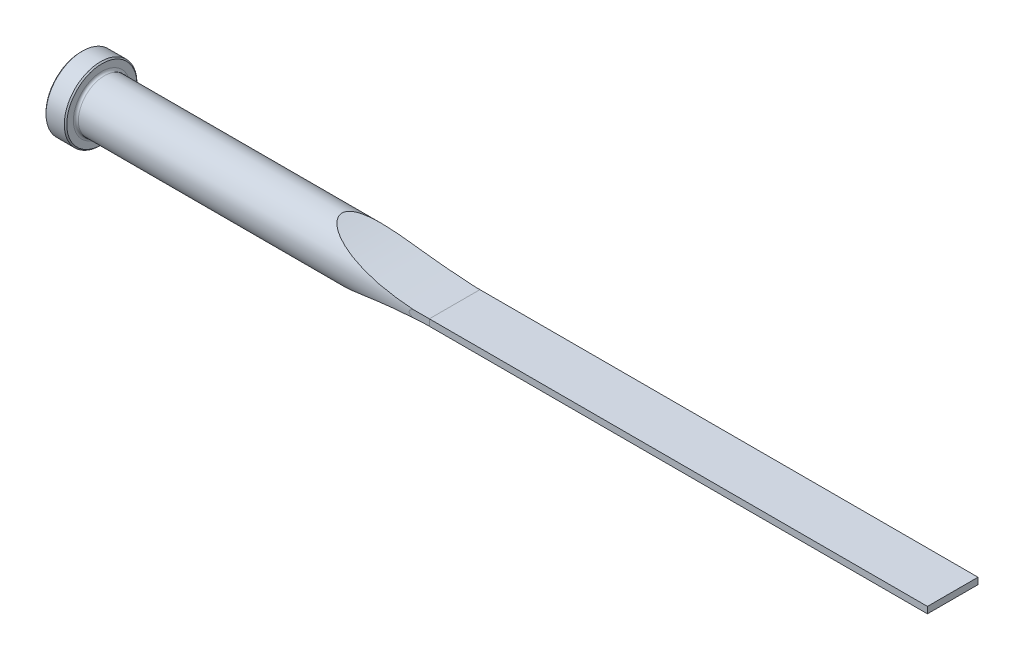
ISO-10303-21;
HEADER;
FILE_DESCRIPTION(('STEP AP214'),'2;1');
FILE_NAME('part.step','',(''),(''),'','','');
FILE_SCHEMA(('AUTOMOTIVE_DESIGN { 1 0 10303 214 1 1 1 1 }'));
ENDSEC;
DATA;
#1=APPLICATION_CONTEXT('core data for automotive mechanical design processes');
#2=APPLICATION_PROTOCOL_DEFINITION('international standard','automotive_design',2000,#1);
#3=PRODUCT_CONTEXT('',#1,'mechanical');
#4=PRODUCT('Part','Part','',(#3));
#5=PRODUCT_RELATED_PRODUCT_CATEGORY('part','',(#4));
#6=PRODUCT_DEFINITION_FORMATION('','',#4);
#7=PRODUCT_DEFINITION_CONTEXT('part definition',#1,'design');
#8=PRODUCT_DEFINITION('design','',#6,#7);
#9=PRODUCT_DEFINITION_SHAPE('','',#8);
#10=(LENGTH_UNIT() NAMED_UNIT(*) SI_UNIT(.MILLI.,.METRE.));
#11=(NAMED_UNIT(*) PLANE_ANGLE_UNIT() SI_UNIT($,.RADIAN.));
#12=(NAMED_UNIT(*) SI_UNIT($,.STERADIAN.) SOLID_ANGLE_UNIT());
#13=UNCERTAINTY_MEASURE_WITH_UNIT(LENGTH_MEASURE(1.E-05),#10,'distance_accuracy_value','');
#14=(GEOMETRIC_REPRESENTATION_CONTEXT(3) GLOBAL_UNCERTAINTY_ASSIGNED_CONTEXT((#13)) GLOBAL_UNIT_ASSIGNED_CONTEXT((#10,
#11,#12)) REPRESENTATION_CONTEXT('',''));
#15=CARTESIAN_POINT('',(0.,0.,0.));
#16=DIRECTION('',(0.,0.,1.));
#17=DIRECTION('',(1.,0.,0.));
#18=AXIS2_PLACEMENT_3D('',#15,#16,#17);
#19=CARTESIAN_POINT('',(0.,0.,0.));
#20=DIRECTION('',(-1.,0.,0.));
#21=DIRECTION('',(0.,0.,1.));
#22=AXIS2_PLACEMENT_3D('',#19,#20,#21);
#23=CYLINDRICAL_SURFACE('',#22,7.9375);
#24=CARTESIAN_POINT('',(7.112,0.,0.));
#25=DIRECTION('',(-1.,0.,0.));
#26=DIRECTION('',(0.,0.,1.));
#27=AXIS2_PLACEMENT_3D('',#24,#25,#26);
#28=CIRCLE('',#27,7.9375);
#29=CARTESIAN_POINT('',(7.112,0.,7.9375));
#30=VERTEX_POINT('',#29);
#31=EDGE_CURVE('E153',#30,#30,#28,.F.);
#32=ORIENTED_EDGE('',*,*,#31,.T.);
#33=EDGE_LOOP('',(#32));
#34=FACE_BOUND('',#33,.T.);
#35=CARTESIAN_POINT('',(114.3,1.78451947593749,7.73429999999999));
#36=CARTESIAN_POINT('',(114.143065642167,1.7845105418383,7.73429977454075));
#37=CARTESIAN_POINT('',(113.986135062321,1.78271922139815,7.73471557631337));
#38=CARTESIAN_POINT('',(113.6723492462,1.77549817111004,7.73637727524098));
#39=CARTESIAN_POINT('',(113.515494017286,1.77006813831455,7.73762324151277));
#40=CARTESIAN_POINT('',(113.044182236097,1.7481634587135,7.74261393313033));
#41=CARTESIAN_POINT('',(112.729981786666,1.72607327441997,7.74761144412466));
#42=CARTESIAN_POINT('',(112.089969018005,1.66408626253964,7.76117477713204));
#43=CARTESIAN_POINT('',(111.764225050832,1.62347858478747,7.76988203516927));
#44=CARTESIAN_POINT('',(111.27855690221,1.5460805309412,7.78551205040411));
#45=CARTESIAN_POINT('',(111.117262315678,1.51755721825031,7.79114576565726));
#46=CARTESIAN_POINT('',(110.795978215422,1.45411431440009,7.80323762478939));
#47=CARTESIAN_POINT('',(110.635988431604,1.41919608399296,7.80969559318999));
#48=CARTESIAN_POINT('',(110.350433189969,1.34959366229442,7.82198684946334));
#49=CARTESIAN_POINT('',(110.224518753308,1.31632189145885,7.82767781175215));
#50=CARTESIAN_POINT('',(109.974290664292,1.24389463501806,7.83951454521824));
#51=CARTESIAN_POINT('',(109.849978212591,1.20473498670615,7.84566063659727));
#52=CARTESIAN_POINT('',(109.604610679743,1.11932874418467,7.85829914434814));
#53=CARTESIAN_POINT('',(109.483540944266,1.07312433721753,7.86478935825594));
#54=CARTESIAN_POINT('',(109.245529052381,0.971242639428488,7.87802451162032));
#55=CARTESIAN_POINT('',(109.128580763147,0.915580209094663,7.88476903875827));
#56=CARTESIAN_POINT('',(108.933202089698,0.807942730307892,7.89640344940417));
#57=CARTESIAN_POINT('',(108.853025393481,0.759165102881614,7.901293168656));
#58=CARTESIAN_POINT('',(108.699386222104,0.652026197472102,7.91085924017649));
#59=CARTESIAN_POINT('',(108.625897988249,0.593704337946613,7.91553637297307));
#60=CARTESIAN_POINT('',(108.527746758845,0.498492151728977,7.92188772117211));
#61=CARTESIAN_POINT('',(108.498030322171,0.46687566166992,7.92382750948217));
#62=CARTESIAN_POINT('',(108.442560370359,0.400245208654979,7.92747295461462));
#63=CARTESIAN_POINT('',(108.416806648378,0.365231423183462,7.92917862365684));
#64=CARTESIAN_POINT('',(108.374409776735,0.297054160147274,7.93200146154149));
#65=CARTESIAN_POINT('',(108.356981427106,0.26438926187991,7.9331684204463));
#66=CARTESIAN_POINT('',(108.327690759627,0.196640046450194,7.93513574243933));
#67=CARTESIAN_POINT('',(108.315817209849,0.161560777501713,7.9359368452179));
#68=CARTESIAN_POINT('',(108.300381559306,0.0956953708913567,7.93697969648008));
#69=CARTESIAN_POINT('',(108.295769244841,0.0651593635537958,7.93729206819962));
#70=CARTESIAN_POINT('',(108.291836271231,0.00374737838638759,7.93755838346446));
#71=CARTESIAN_POINT('',(108.292513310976,-0.0271284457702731,7.9375124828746));
#72=CARTESIAN_POINT('',(108.299074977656,-0.0882381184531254,7.93706831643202));
#73=CARTESIAN_POINT('',(108.304948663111,-0.118473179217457,7.936670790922));
#74=CARTESIAN_POINT('',(108.321303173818,-0.177660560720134,7.93556691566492));
#75=CARTESIAN_POINT('',(108.331788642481,-0.206611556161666,7.9348602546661));
#76=CARTESIAN_POINT('',(108.362659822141,-0.276684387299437,7.93278744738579));
#77=CARTESIAN_POINT('',(108.385377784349,-0.316766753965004,7.93126793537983));
#78=CARTESIAN_POINT('',(108.436699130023,-0.392925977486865,7.92786070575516));
#79=CARTESIAN_POINT('',(108.465317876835,-0.428991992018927,7.92597202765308));
#80=CARTESIAN_POINT('',(108.551957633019,-0.525999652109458,7.92030384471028));
#81=CARTESIAN_POINT('',(108.61464586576,-0.582701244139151,7.91625752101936));
#82=CARTESIAN_POINT('',(108.746996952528,-0.687133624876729,7.90787418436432));
#83=CARTESIAN_POINT('',(108.816681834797,-0.734834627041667,7.90353626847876));
#84=CARTESIAN_POINT('',(108.998064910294,-0.847009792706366,7.8924751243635));
#85=CARTESIAN_POINT('',(109.112494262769,-0.907015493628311,7.88570351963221));
#86=CARTESIAN_POINT('',(109.346394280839,-1.01644666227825,7.87233944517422));
#87=CARTESIAN_POINT('',(109.465875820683,-1.06584775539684,7.86574741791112));
#88=CARTESIAN_POINT('',(109.70896357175,-1.15711870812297,7.85284174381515));
#89=CARTESIAN_POINT('',(109.83259813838,-1.19891277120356,7.84653132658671));
#90=CARTESIAN_POINT('',(110.081692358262,-1.27609049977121,7.83434823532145));
#91=CARTESIAN_POINT('',(110.207149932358,-1.31148093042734,7.82847510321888));
#92=CARTESIAN_POINT('',(110.499340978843,-1.38743337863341,7.81542475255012));
#93=CARTESIAN_POINT('',(110.666575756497,-1.42608925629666,7.80842280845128));
#94=CARTESIAN_POINT('',(111.002620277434,-1.49607651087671,7.79531303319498));
#95=CARTESIAN_POINT('',(111.17143044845,-1.52740583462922,7.78920545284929));
#96=CARTESIAN_POINT('',(111.68004542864,-1.61220099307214,7.77226680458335));
#97=CARTESIAN_POINT('',(112.021464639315,-1.65633549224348,7.76284544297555));
#98=CARTESIAN_POINT('',(112.686114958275,-1.72271499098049,7.74836524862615));
#99=CARTESIAN_POINT('',(113.00923448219,-1.74609496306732,7.7430823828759));
#100=CARTESIAN_POINT('',(113.493821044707,-1.76925595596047,7.7378094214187));
#101=CARTESIAN_POINT('',(113.655007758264,-1.7749918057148,7.73649365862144));
#102=CARTESIAN_POINT('',(113.977461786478,-1.78261828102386,7.73473885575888));
#103=CARTESIAN_POINT('',(114.138729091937,-1.78450927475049,7.73429973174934));
#104=CARTESIAN_POINT('',(114.3,-1.78451947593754,7.73429999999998));
#105=B_SPLINE_CURVE_WITH_KNOTS('',3,(#35,#36,#37,#38,#39,#40,#41,#42,#43,#44,#45,#46,#47,#48,
#49,#50,#51,#52,#53,#54,#55,#56,#57,#58,#59,#60,#61,#62,#63,#64,#65,#66,#67,#68,#69,#70,#71,#72,
#73,#74,#75,#76,#77,#78,#79,#80,#81,#82,#83,#84,#85,#86,#87,#88,#89,#90,#91,#92,#93,#94,#95,#96,
#97,#98,#99,#100,#101,#102,#103,#104),.UNSPECIFIED.,.F.,.F.,(4,2,2,2,2,2,2,2,2,2,2,2,2,2,2,2,2,
2,2,2,2,2,2,2,2,2,2,2,2,2,2,2,2,2,4),(0.,0.470784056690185,0.94160731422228,1.88625719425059,
2.87069717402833,3.36228091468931,3.85376017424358,4.24473219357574,4.63598193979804,
5.02497459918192,5.4133616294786,5.69491367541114,5.97533094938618,6.10540702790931,
6.23547631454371,6.34621180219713,6.45672240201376,6.54894631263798,6.64113010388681,
6.73312026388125,6.82520325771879,6.96270105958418,7.10056147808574,7.3530071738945,
7.6062741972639,7.9934651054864,8.38153665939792,8.7732853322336,9.16461769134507,
9.67975694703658,10.1950403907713,11.2273641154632,12.1989586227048,12.6827980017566,
13.1665910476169),.UNSPECIFIED.);
#106=CARTESIAN_POINT('',(109.597039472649,1.11508444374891,7.85878444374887));
#107=VERTEX_POINT('',#106);
#108=CARTESIAN_POINT('',(109.59703947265,-1.11508444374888,7.85878444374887));
#109=VERTEX_POINT('',#108);
#110=EDGE_CURVE('E156',#107,#109,#105,.T.);
#111=ORIENTED_EDGE('',*,*,#110,.F.);
#112=CARTESIAN_POINT('',(114.3,0.990600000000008,7.8754439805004));
#113=CARTESIAN_POINT('',(113.636709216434,0.990598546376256,7.87539803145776));
#114=CARTESIAN_POINT('',(112.97341757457,0.998023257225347,7.87450855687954));
#115=CARTESIAN_POINT('',(111.64716543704,1.02771482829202,7.87071326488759));
#116=CARTESIAN_POINT('',(110.984204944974,1.04998184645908,7.86780742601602));
#117=CARTESIAN_POINT('',(109.658595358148,1.10936428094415,7.85964784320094));
#118=CARTESIAN_POINT('',(108.995946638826,1.14648790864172,7.85439280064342));
#119=CARTESIAN_POINT('',(107.671678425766,1.23556206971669,7.84087600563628));
#120=CARTESIAN_POINT('',(107.010058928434,1.28751255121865,7.83261426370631));
#121=CARTESIAN_POINT('',(105.684777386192,1.40651744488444,7.81212374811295));
#122=CARTESIAN_POINT('',(105.021122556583,1.47364883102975,7.79987461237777));
#123=CARTESIAN_POINT('',(103.695605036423,1.62281646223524,7.77020977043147));
#124=CARTESIAN_POINT('',(103.033742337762,1.70485263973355,7.75279408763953));
#125=CARTESIAN_POINT('',(101.712439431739,1.88373867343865,7.71128161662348));
#126=CARTESIAN_POINT('',(101.05299853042,1.98058388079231,7.68718692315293));
#127=CARTESIAN_POINT('',(99.7368236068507,2.18901625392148,7.63045191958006));
#128=CARTESIAN_POINT('',(99.0800895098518,2.30060300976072,7.59781184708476));
#129=CARTESIAN_POINT('',(97.940821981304,2.50736667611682,7.53163390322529));
#130=CARTESIAN_POINT('',(97.457542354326,2.59922942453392,7.50055200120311));
#131=CARTESIAN_POINT('',(96.4930605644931,2.79086047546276,7.43137874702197));
#132=CARTESIAN_POINT('',(96.011858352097,2.8906285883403,7.393287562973));
#133=CARTESIAN_POINT('',(95.051620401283,3.09802389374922,7.30880978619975));
#134=CARTESIAN_POINT('',(94.5725858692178,3.20565499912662,7.26241904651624));
#135=CARTESIAN_POINT('',(93.6173515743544,3.4285934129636,7.15986832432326));
#136=CARTESIAN_POINT('',(93.1411517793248,3.54390063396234,7.10370845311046));
#137=CARTESIAN_POINT('',(92.1908811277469,3.78231096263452,6.97969485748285));
#138=CARTESIAN_POINT('',(91.7168190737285,3.9054336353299,6.91181098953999));
#139=CARTESIAN_POINT('',(90.7727565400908,4.15893910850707,6.76230752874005));
#140=CARTESIAN_POINT('',(90.3027563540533,4.28932242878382,6.68068695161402));
#141=CARTESIAN_POINT('',(89.3683216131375,4.55680045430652,6.50118449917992));
#142=CARTESIAN_POINT('',(88.9038817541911,4.69388800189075,6.40331971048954));
#143=CARTESIAN_POINT('',(87.9814861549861,4.97430006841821,6.18801717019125));
#144=CARTESIAN_POINT('',(87.5235290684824,5.11762326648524,6.07058354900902));
#145=CARTESIAN_POINT('',(86.8402364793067,5.33748269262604,5.87578702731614));
#146=CARTESIAN_POINT('',(86.6117252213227,5.41204203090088,5.80728075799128));
#147=CARTESIAN_POINT('',(86.1572536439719,5.56235396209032,5.66347586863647));
#148=CARTESIAN_POINT('',(85.9312931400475,5.63810646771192,5.58817774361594));
#149=CARTESIAN_POINT('',(85.4820897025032,5.79069284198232,5.42990609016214));
#150=CARTESIAN_POINT('',(85.2588504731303,5.86752793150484,5.34692318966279));
#151=CARTESIAN_POINT('',(84.8159717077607,6.02191062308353,5.172434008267));
#152=CARTESIAN_POINT('',(84.596332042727,6.09945819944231,5.08092803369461));
#153=CARTESIAN_POINT('',(84.1632897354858,6.2542376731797,4.88911832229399));
#154=CARTESIAN_POINT('',(83.9498497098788,6.331466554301,4.78889696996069));
#155=CARTESIAN_POINT('',(83.528227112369,6.48581366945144,4.57769006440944));
#156=CARTESIAN_POINT('',(83.3200455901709,6.56293187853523,4.46670238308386));
#157=CARTESIAN_POINT('',(82.9108396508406,6.71621550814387,4.23271539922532));
#158=CARTESIAN_POINT('',(82.7097999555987,6.79238270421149,4.10974414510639));
#159=CARTESIAN_POINT('',(82.316381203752,6.94301169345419,3.84981399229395));
#160=CARTESIAN_POINT('',(82.123996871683,7.01747451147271,3.71286378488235));
#161=CARTESIAN_POINT('',(81.8168987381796,7.13750403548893,3.47431658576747));
#162=CARTESIAN_POINT('',(81.6988621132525,7.18394265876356,3.37743358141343));
#163=CARTESIAN_POINT('',(81.4684957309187,7.27511925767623,3.1762793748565));
#164=CARTESIAN_POINT('',(81.3561667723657,7.31985699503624,3.07200714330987));
#165=CARTESIAN_POINT('',(81.1386213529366,7.40698540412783,2.85553349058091));
#166=CARTESIAN_POINT('',(81.0333982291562,7.44937826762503,2.74333970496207));
#167=CARTESIAN_POINT('',(80.8316535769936,7.53107328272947,2.51039195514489));
#168=CARTESIAN_POINT('',(80.7351284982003,7.57037669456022,2.38964151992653));
#169=CARTESIAN_POINT('',(80.5184357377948,7.65901103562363,2.09185418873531));
#170=CARTESIAN_POINT('',(80.4030268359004,7.70655492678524,1.9107262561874));
#171=CARTESIAN_POINT('',(80.1995091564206,7.79079045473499,1.53135329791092));
#172=CARTESIAN_POINT('',(80.1113595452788,7.82749831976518,1.33313444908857));
#173=CARTESIAN_POINT('',(79.9825898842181,7.88127500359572,0.958459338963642));
#174=CARTESIAN_POINT('',(79.936340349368,7.90066111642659,0.784297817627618));
#175=CARTESIAN_POINT('',(79.8715916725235,7.92782806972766,0.430014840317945));
#176=CARTESIAN_POINT('',(79.8530686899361,7.9356188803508,0.249898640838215));
#177=CARTESIAN_POINT('',(79.8455549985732,7.93877728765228,-0.111437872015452));
#178=CARTESIAN_POINT('',(79.8566234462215,7.93411999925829,-0.292659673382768));
#179=CARTESIAN_POINT('',(79.9072867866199,7.91284701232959,-0.650347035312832));
#180=CARTESIAN_POINT('',(79.9469020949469,7.89622275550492,-0.826809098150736));
#181=CARTESIAN_POINT('',(80.0629907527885,7.84767250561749,-1.20959062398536));
#182=CARTESIAN_POINT('',(80.1457719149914,7.81313689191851,-1.41364149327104));
#183=CARTESIAN_POINT('',(80.3408366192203,7.73223905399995,-1.80457425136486));
#184=CARTESIAN_POINT('',(80.4531770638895,7.68585402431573,-1.99142207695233));
#185=CARTESIAN_POINT('',(80.6721592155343,7.5960735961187,-2.30741817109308));
#186=CARTESIAN_POINT('',(80.7744606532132,7.55432796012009,-2.4401274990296));
#187=CARTESIAN_POINT('',(80.9896236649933,7.46704570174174,-2.69543072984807));
#188=CARTESIAN_POINT('',(81.1024914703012,7.42150684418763,-2.81801858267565));
#189=CARTESIAN_POINT('',(81.3367388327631,7.32759763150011,-3.05390973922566));
#190=CARTESIAN_POINT('',(81.4581307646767,7.27922317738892,-3.16719900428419));
#191=CARTESIAN_POINT('',(81.7076763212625,7.18045252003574,-3.3851596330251));
#192=CARTESIAN_POINT('',(81.8358325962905,7.13005552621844,-3.4898275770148));
#193=CARTESIAN_POINT('',(82.2212726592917,6.97956546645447,-3.7865569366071));
#194=CARTESIAN_POINT('',(82.4861649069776,6.87750341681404,-3.96776311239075));
#195=CARTESIAN_POINT('',(83.030220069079,6.67103578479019,-4.30585220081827));
#196=CARTESIAN_POINT('',(83.3093967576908,6.56662799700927,-4.4627110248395));
#197=CARTESIAN_POINT('',(83.8786496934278,6.35711199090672,-4.75643046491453));
#198=CARTESIAN_POINT('',(84.1687493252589,6.25200271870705,-4.89324470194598));
#199=CARTESIAN_POINT('',(84.6095769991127,6.09493680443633,-5.08551469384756));
#200=CARTESIAN_POINT('',(84.757440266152,6.0426900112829,-5.14743668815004));
#201=CARTESIAN_POINT('',(85.0548758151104,5.93848549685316,-5.26731527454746));
#202=CARTESIAN_POINT('',(85.2044481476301,5.88652778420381,-5.32527174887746));
#203=CARTESIAN_POINT('',(85.5824145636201,5.75637249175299,-5.46639393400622));
#204=CARTESIAN_POINT('',(85.8117794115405,5.6784245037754,-5.54719284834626));
#205=CARTESIAN_POINT('',(86.2733998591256,5.52366932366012,-5.70130566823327));
#206=CARTESIAN_POINT('',(86.5056557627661,5.44686225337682,-5.7746187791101));
#207=CARTESIAN_POINT('',(87.2062522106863,5.21840848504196,-5.98456770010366));
#208=CARTESIAN_POINT('',(87.678278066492,5.06877868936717,-6.11116079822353));
#209=CARTESIAN_POINT('',(88.6304026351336,4.77579215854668,-6.34275624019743));
#210=CARTESIAN_POINT('',(89.1105145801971,4.63244744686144,-6.44771851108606));
#211=CARTESIAN_POINT('',(90.0763103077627,4.35303209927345,-6.63955707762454));
#212=CARTESIAN_POINT('',(90.5619931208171,4.2169602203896,-6.72643647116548));
#213=CARTESIAN_POINT('',(91.5414562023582,3.95156312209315,-6.88572178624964));
#214=CARTESIAN_POINT('',(92.0352697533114,3.82229487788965,-6.9580165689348));
#215=CARTESIAN_POINT('',(93.026656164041,3.57190994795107,-7.08980746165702));
#216=CARTESIAN_POINT('',(93.5242291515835,3.45079354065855,-7.14930313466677));
#217=CARTESIAN_POINT('',(94.5220057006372,3.21705592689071,-7.25748028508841));
#218=CARTESIAN_POINT('',(95.022206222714,3.10442654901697,-7.30617225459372));
#219=CARTESIAN_POINT('',(96.0252509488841,2.88768712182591,-7.39451476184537));
#220=CARTESIAN_POINT('',(96.528095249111,2.78357738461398,-7.43416496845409));
#221=CARTESIAN_POINT('',(97.7494839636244,2.54172921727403,-7.52106100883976));
#222=CARTESIAN_POINT('',(98.4691864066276,2.40842257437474,-7.56441165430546));
#223=CARTESIAN_POINT('',(99.9122741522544,2.15953627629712,-7.63918584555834));
#224=CARTESIAN_POINT('',(100.635659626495,2.04395745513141,-7.67060883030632));
#225=CARTESIAN_POINT('',(102.085794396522,1.83061714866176,-7.72430255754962));
#226=CARTESIAN_POINT('',(102.812545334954,1.7328655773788,-7.74656821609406));
#227=CARTESIAN_POINT('',(104.26841925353,1.55535689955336,-7.7841503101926));
#228=CARTESIAN_POINT('',(104.997542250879,1.47559992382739,-7.79946669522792));
#229=CARTESIAN_POINT('',(106.439986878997,1.33585716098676,-7.82459607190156));
#230=CARTESIAN_POINT('',(107.153264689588,1.27544026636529,-7.83453308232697));
#231=CARTESIAN_POINT('',(108.58111257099,1.17184940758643,-7.85069558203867));
#232=CARTESIAN_POINT('',(109.295682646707,1.12867550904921,-7.85692105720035));
#233=CARTESIAN_POINT('',(110.725010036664,1.059631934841,-7.86653071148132));
#234=CARTESIAN_POINT('',(111.439766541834,1.03374601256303,-7.86991755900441));
#235=CARTESIAN_POINT('',(112.512198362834,1.00785903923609,-7.87325790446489));
#236=CARTESIAN_POINT('',(112.869725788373,1.0013870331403,-7.87408136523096));
#237=CARTESIAN_POINT('',(113.584834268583,0.992757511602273,-7.87517298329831));
#238=CARTESIAN_POINT('',(113.94241532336,0.990600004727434,-7.8754411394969));
#239=CARTESIAN_POINT('',(114.3,0.99060000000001,-7.8754439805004));
#240=B_SPLINE_CURVE_WITH_KNOTS('',3,(#112,#113,#114,#115,#116,#117,#118,#119,#120,#121,#122,
#123,#124,#125,#126,#127,#128,#129,#130,#131,#132,#133,#134,#135,#136,#137,#138,#139,#140,#141,
#142,#143,#144,#145,#146,#147,#148,#149,#150,#151,#152,#153,#154,#155,#156,#157,#158,#159,#160,
#161,#162,#163,#164,#165,#166,#167,#168,#169,#170,#171,#172,#173,#174,#175,#176,#177,#178,#179,
#180,#181,#182,#183,#184,#185,#186,#187,#188,#189,#190,#191,#192,#193,#194,#195,#196,#197,#198,
#199,#200,#201,#202,#203,#204,#205,#206,#207,#208,#209,#210,#211,#212,#213,#214,#215,#216,#217,
#218,#219,#220,#221,#222,#223,#224,#225,#226,#227,#228,#229,#230,#231,#232,#233,#234,#235,#236,
#237,#238,#239),.UNSPECIFIED.,.F.,.F.,(4,2,2,2,2,2,2,2,2,2,2,2,2,2,2,2,2,2,2,2,2,2,2,2,2,2,2,2,
2,2,2,2,2,2,2,2,2,2,2,2,2,2,2,2,2,2,2,2,2,2,2,2,2,2,2,2,2,2,2,2,2,2,2,4),(0.,1.98983159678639,
3.97968436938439,5.97063847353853,7.96158561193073,9.96286356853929,11.9641324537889,
13.9647743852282,15.9653606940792,17.4439981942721,18.9226002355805,20.4019431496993,
21.881269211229,23.3644569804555,24.8477510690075,26.3294947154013,27.8109260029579,
28.5606563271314,29.3103320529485,30.0609344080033,30.8115097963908,31.5556334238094,
32.2999044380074,33.0424734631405,33.7845835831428,34.2631819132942,34.7418470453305,
35.2200569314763,35.6980707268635,36.3558379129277,37.0126149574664,37.5540056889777,
38.0949306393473,38.6369377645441,39.1793328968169,39.8443461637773,40.5106490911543,
41.0279992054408,41.5456563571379,42.064081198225,42.5827106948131,43.5913087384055,
44.6008983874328,45.6127883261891,46.1185610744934,46.6243488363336,47.3902949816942,
48.1563223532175,49.6888577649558,51.22420730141,52.7592935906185,54.30566913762,
55.8520974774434,57.3970173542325,58.9419938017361,61.1413024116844,63.3407144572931,
65.5413459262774,67.7419933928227,69.8894745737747,72.03696392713,74.1824322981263,
75.2551703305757,76.3279104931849),.UNSPECIFIED.);
#241=CARTESIAN_POINT('',(109.59703947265,1.11508444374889,-7.85878444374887));
#242=VERTEX_POINT('',#241);
#243=EDGE_CURVE('E106',#107,#242,#240,.T.);
#244=ORIENTED_EDGE('',*,*,#243,.T.);
#245=CARTESIAN_POINT('',(114.3,1.78451947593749,-7.73429999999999));
#246=CARTESIAN_POINT('',(114.143065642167,1.78451054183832,-7.73429977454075));
#247=CARTESIAN_POINT('',(113.986135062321,1.78271922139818,-7.73471557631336));
#248=CARTESIAN_POINT('',(113.6723492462,1.77549817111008,-7.73637727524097));
#249=CARTESIAN_POINT('',(113.515494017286,1.77006813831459,-7.73762324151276));
#250=CARTESIAN_POINT('',(113.044182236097,1.74816345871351,-7.74261393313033));
#251=CARTESIAN_POINT('',(112.729981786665,1.72607327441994,-7.74761144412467));
#252=CARTESIAN_POINT('',(112.089969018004,1.66408626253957,-7.76117477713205));
#253=CARTESIAN_POINT('',(111.764225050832,1.62347858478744,-7.76988203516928));
#254=CARTESIAN_POINT('',(111.278556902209,1.54608053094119,-7.78551205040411));
#255=CARTESIAN_POINT('',(111.117262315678,1.51755721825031,-7.79114576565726));
#256=CARTESIAN_POINT('',(110.795978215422,1.4541143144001,-7.80323762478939));
#257=CARTESIAN_POINT('',(110.635988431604,1.41919608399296,-7.80969559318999));
#258=CARTESIAN_POINT('',(110.350433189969,1.3495936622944,-7.82198684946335));
#259=CARTESIAN_POINT('',(110.224518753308,1.3163218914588,-7.82767781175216));
#260=CARTESIAN_POINT('',(109.974290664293,1.24389463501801,-7.83951454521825));
#261=CARTESIAN_POINT('',(109.849978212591,1.20473498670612,-7.84566063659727));
#262=CARTESIAN_POINT('',(109.604610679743,1.11932874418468,-7.85829914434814));
#263=CARTESIAN_POINT('',(109.483540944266,1.07312433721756,-7.86478935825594));
#264=CARTESIAN_POINT('',(109.24552905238,0.971242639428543,-7.87802451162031));
#265=CARTESIAN_POINT('',(109.128580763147,0.91558020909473,-7.88476903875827));
#266=CARTESIAN_POINT('',(108.933202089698,0.80794273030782,-7.89640344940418));
#267=CARTESIAN_POINT('',(108.853025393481,0.759165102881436,-7.90129316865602));
#268=CARTESIAN_POINT('',(108.699386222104,0.652026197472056,-7.9108592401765));
#269=CARTESIAN_POINT('',(108.625897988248,0.593704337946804,-7.91553637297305));
#270=CARTESIAN_POINT('',(108.527746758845,0.498492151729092,-7.9218877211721));
#271=CARTESIAN_POINT('',(108.498030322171,0.466875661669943,-7.92382750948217));
#272=CARTESIAN_POINT('',(108.442560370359,0.400245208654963,-7.92747295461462));
#273=CARTESIAN_POINT('',(108.416806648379,0.365231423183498,-7.92917862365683));
#274=CARTESIAN_POINT('',(108.374409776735,0.297054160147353,-7.93200146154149));
#275=CARTESIAN_POINT('',(108.356981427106,0.264389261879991,-7.9331684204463));
#276=CARTESIAN_POINT('',(108.327690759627,0.196640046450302,-7.93513574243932));
#277=CARTESIAN_POINT('',(108.315817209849,0.161560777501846,-7.9359368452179));
#278=CARTESIAN_POINT('',(108.300381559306,0.095695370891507,-7.93697969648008));
#279=CARTESIAN_POINT('',(108.295769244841,0.0651593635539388,-7.93729206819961));
#280=CARTESIAN_POINT('',(108.291836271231,0.00374737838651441,-7.93755838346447));
#281=CARTESIAN_POINT('',(108.292513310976,-0.0271284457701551,-7.9375124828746));
#282=CARTESIAN_POINT('',(108.299074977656,-0.0882381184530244,-7.93706831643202));
#283=CARTESIAN_POINT('',(108.304948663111,-0.118473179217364,-7.936670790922));
#284=CARTESIAN_POINT('',(108.321303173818,-0.177660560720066,-7.93556691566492));
#285=CARTESIAN_POINT('',(108.331788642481,-0.206611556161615,-7.9348602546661));
#286=CARTESIAN_POINT('',(108.362659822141,-0.276684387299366,-7.93278744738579));
#287=CARTESIAN_POINT('',(108.385377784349,-0.316766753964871,-7.93126793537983));
#288=CARTESIAN_POINT('',(108.436699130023,-0.39292597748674,-7.92786070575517));
#289=CARTESIAN_POINT('',(108.465317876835,-0.42899199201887,-7.92597202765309));
#290=CARTESIAN_POINT('',(108.551957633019,-0.525999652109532,-7.92030384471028));
#291=CARTESIAN_POINT('',(108.614645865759,-0.582701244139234,-7.91625752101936));
#292=CARTESIAN_POINT('',(108.746996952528,-0.68713362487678,-7.90787418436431));
#293=CARTESIAN_POINT('',(108.816681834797,-0.734834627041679,-7.90353626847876));
#294=CARTESIAN_POINT('',(108.998064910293,-0.847009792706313,-7.89247512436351));
#295=CARTESIAN_POINT('',(109.112494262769,-0.907015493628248,-7.88570351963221));
#296=CARTESIAN_POINT('',(109.346394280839,-1.01644666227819,-7.87233944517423));
#297=CARTESIAN_POINT('',(109.465875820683,-1.06584775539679,-7.86574741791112));
#298=CARTESIAN_POINT('',(109.70896357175,-1.15711870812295,-7.85284174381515));
#299=CARTESIAN_POINT('',(109.83259813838,-1.19891277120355,-7.84653132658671));
#300=CARTESIAN_POINT('',(110.081692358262,-1.27609049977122,-7.83434823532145));
#301=CARTESIAN_POINT('',(110.207149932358,-1.31148093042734,-7.82847510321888));
#302=CARTESIAN_POINT('',(110.499340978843,-1.3874333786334,-7.81542475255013));
#303=CARTESIAN_POINT('',(110.666575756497,-1.42608925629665,-7.80842280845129));
#304=CARTESIAN_POINT('',(111.002620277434,-1.49607651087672,-7.79531303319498));
#305=CARTESIAN_POINT('',(111.17143044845,-1.52740583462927,-7.78920545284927));
#306=CARTESIAN_POINT('',(111.68004542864,-1.61220099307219,-7.77226680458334));
#307=CARTESIAN_POINT('',(112.021464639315,-1.65633549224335,-7.76284544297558));
#308=CARTESIAN_POINT('',(112.686114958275,-1.72271499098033,-7.74836524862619));
#309=CARTESIAN_POINT('',(113.00923448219,-1.74609496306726,-7.74308238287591));
#310=CARTESIAN_POINT('',(113.493821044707,-1.76925595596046,-7.7378094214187));
#311=CARTESIAN_POINT('',(113.655007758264,-1.77499180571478,-7.73649365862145));
#312=CARTESIAN_POINT('',(113.977461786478,-1.78261828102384,-7.73473885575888));
#313=CARTESIAN_POINT('',(114.138729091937,-1.78450927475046,-7.73429973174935));
#314=CARTESIAN_POINT('',(114.3,-1.78451947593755,-7.73429999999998));
#315=B_SPLINE_CURVE_WITH_KNOTS('',3,(#245,#246,#247,#248,#249,#250,#251,#252,#253,#254,#255,
#256,#257,#258,#259,#260,#261,#262,#263,#264,#265,#266,#267,#268,#269,#270,#271,#272,#273,#274,
#275,#276,#277,#278,#279,#280,#281,#282,#283,#284,#285,#286,#287,#288,#289,#290,#291,#292,#293,
#294,#295,#296,#297,#298,#299,#300,#301,#302,#303,#304,#305,#306,#307,#308,#309,#310,#311,#312,
#313,#314),.UNSPECIFIED.,.F.,.F.,(4,2,2,2,2,2,2,2,2,2,2,2,2,2,2,2,2,2,2,2,2,2,2,2,2,2,2,2,2,2,2,
2,2,2,4),(0.,0.470784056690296,0.941607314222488,1.88625719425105,2.87069717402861,
3.36228091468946,3.8537601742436,4.24473219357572,4.63598193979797,5.0249745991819,
5.41336162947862,5.69491367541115,5.97533094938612,6.10540702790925,6.23547631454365,
6.34621180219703,6.45672240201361,6.54894631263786,6.64113010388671,6.73312026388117,
6.82520325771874,6.96270105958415,7.10056147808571,7.35300717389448,7.60627419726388,
7.9934651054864,8.38153665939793,8.77328533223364,9.16461769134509,9.67975694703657,
10.1950403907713,11.2273641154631,12.1989586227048,12.6827980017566,13.1665910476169),.UNSPECIFIED.);
#316=CARTESIAN_POINT('',(109.59703947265,-1.11508444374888,-7.85878444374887));
#317=VERTEX_POINT('',#316);
#318=EDGE_CURVE('E175',#242,#317,#315,.T.);
#319=ORIENTED_EDGE('',*,*,#318,.T.);
#320=CARTESIAN_POINT('',(114.3,-0.990600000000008,7.8754439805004));
#321=CARTESIAN_POINT('',(113.636709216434,-0.990598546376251,7.87539803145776));
#322=CARTESIAN_POINT('',(112.97341757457,-0.99802325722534,7.87450855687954));
#323=CARTESIAN_POINT('',(111.64716543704,-1.02771482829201,7.87071326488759));
#324=CARTESIAN_POINT('',(110.984204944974,-1.04998184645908,7.86780742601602));
#325=CARTESIAN_POINT('',(109.658595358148,-1.10936428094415,7.85964784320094));
#326=CARTESIAN_POINT('',(108.995946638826,-1.14648790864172,7.85439280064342));
#327=CARTESIAN_POINT('',(107.671678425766,-1.23556206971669,7.84087600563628));
#328=CARTESIAN_POINT('',(107.010058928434,-1.28751255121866,7.83261426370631));
#329=CARTESIAN_POINT('',(105.684777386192,-1.40651744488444,7.81212374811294));
#330=CARTESIAN_POINT('',(105.021122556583,-1.47364883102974,7.79987461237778));
#331=CARTESIAN_POINT('',(103.695605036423,-1.62281646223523,7.77020977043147));
#332=CARTESIAN_POINT('',(103.033742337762,-1.70485263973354,7.75279408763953));
#333=CARTESIAN_POINT('',(101.712439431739,-1.88373867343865,7.71128161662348));
#334=CARTESIAN_POINT('',(101.05299853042,-1.98058388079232,7.68718692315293));
#335=CARTESIAN_POINT('',(99.7368236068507,-2.18901625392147,7.63045191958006));
#336=CARTESIAN_POINT('',(99.0800895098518,-2.30060300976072,7.59781184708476));
#337=CARTESIAN_POINT('',(97.940821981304,-2.50736667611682,7.53163390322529));
#338=CARTESIAN_POINT('',(97.457542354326,-2.59922942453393,7.50055200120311));
#339=CARTESIAN_POINT('',(96.4930605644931,-2.79086047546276,7.43137874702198));
#340=CARTESIAN_POINT('',(96.011858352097,-2.89062858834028,7.39328756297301));
#341=CARTESIAN_POINT('',(95.051620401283,-3.09802389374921,7.30880978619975));
#342=CARTESIAN_POINT('',(94.5725858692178,-3.20565499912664,7.26241904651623));
#343=CARTESIAN_POINT('',(93.6173515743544,-3.42859341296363,7.15986832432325));
#344=CARTESIAN_POINT('',(93.1411517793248,-3.54390063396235,7.10370845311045));
#345=CARTESIAN_POINT('',(92.1908811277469,-3.78231096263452,6.97969485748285));
#346=CARTESIAN_POINT('',(91.7168190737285,-3.9054336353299,6.91181098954));
#347=CARTESIAN_POINT('',(90.7727565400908,-4.15893910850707,6.76230752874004));
#348=CARTESIAN_POINT('',(90.3027563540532,-4.28932242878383,6.68068695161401));
#349=CARTESIAN_POINT('',(89.3683216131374,-4.55680045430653,6.50118449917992));
#350=CARTESIAN_POINT('',(88.9038817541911,-4.69388800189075,6.40331971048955));
#351=CARTESIAN_POINT('',(87.981486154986,-4.9743000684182,6.18801717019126));
#352=CARTESIAN_POINT('',(87.5235290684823,-5.11762326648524,6.07058354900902));
#353=CARTESIAN_POINT('',(86.8402364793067,-5.33748269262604,5.87578702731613));
#354=CARTESIAN_POINT('',(86.6117252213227,-5.41204203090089,5.80728075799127));
#355=CARTESIAN_POINT('',(86.1572536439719,-5.56235396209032,5.66347586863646));
#356=CARTESIAN_POINT('',(85.9312931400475,-5.63810646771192,5.58817774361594));
#357=CARTESIAN_POINT('',(85.4820897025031,-5.79069284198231,5.42990609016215));
#358=CARTESIAN_POINT('',(85.2588504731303,-5.86752793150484,5.3469231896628));
#359=CARTESIAN_POINT('',(84.8159717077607,-6.02191062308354,5.17243400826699));
#360=CARTESIAN_POINT('',(84.596332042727,-6.09945819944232,5.0809280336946));
#361=CARTESIAN_POINT('',(84.1632897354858,-6.2542376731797,4.88911832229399));
#362=CARTESIAN_POINT('',(83.9498497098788,-6.33146655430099,4.7888969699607));
#363=CARTESIAN_POINT('',(83.528227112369,-6.48581366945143,4.57769006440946));
#364=CARTESIAN_POINT('',(83.3200455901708,-6.56293187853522,4.46670238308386));
#365=CARTESIAN_POINT('',(82.9108396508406,-6.71621550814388,4.23271539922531));
#366=CARTESIAN_POINT('',(82.7097999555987,-6.7923827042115,4.10974414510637));
#367=CARTESIAN_POINT('',(82.316381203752,-6.9430116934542,3.84981399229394));
#368=CARTESIAN_POINT('',(82.123996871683,-7.01747451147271,3.71286378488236));
#369=CARTESIAN_POINT('',(81.8168987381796,-7.13750403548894,3.47431658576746));
#370=CARTESIAN_POINT('',(81.6988621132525,-7.18394265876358,3.3774335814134));
#371=CARTESIAN_POINT('',(81.4684957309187,-7.27511925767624,3.17627937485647));
#372=CARTESIAN_POINT('',(81.3561667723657,-7.31985699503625,3.07200714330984));
#373=CARTESIAN_POINT('',(81.1386213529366,-7.40698540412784,2.8555334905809));
#374=CARTESIAN_POINT('',(81.0333982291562,-7.44937826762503,2.74333970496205));
#375=CARTESIAN_POINT('',(80.8316535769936,-7.53107328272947,2.51039195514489));
#376=CARTESIAN_POINT('',(80.7351284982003,-7.57037669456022,2.38964151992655));
#377=CARTESIAN_POINT('',(80.5184357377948,-7.65901103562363,2.09185418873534));
#378=CARTESIAN_POINT('',(80.4030268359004,-7.70655492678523,1.91072625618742));
#379=CARTESIAN_POINT('',(80.1995091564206,-7.79079045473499,1.53135329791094));
#380=CARTESIAN_POINT('',(80.1113595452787,-7.82749831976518,1.33313444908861));
#381=CARTESIAN_POINT('',(79.9825898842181,-7.88127500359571,0.958459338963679));
#382=CARTESIAN_POINT('',(79.936340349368,-7.90066111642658,0.784297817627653));
#383=CARTESIAN_POINT('',(79.8715916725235,-7.92782806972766,0.430014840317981));
#384=CARTESIAN_POINT('',(79.8530686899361,-7.9356188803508,0.249898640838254));
#385=CARTESIAN_POINT('',(79.8455549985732,-7.93877728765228,-0.111437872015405));
#386=CARTESIAN_POINT('',(79.8566234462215,-7.9341199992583,-0.292659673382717));
#387=CARTESIAN_POINT('',(79.9072867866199,-7.91284701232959,-0.650347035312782));
#388=CARTESIAN_POINT('',(79.9469020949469,-7.89622275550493,-0.826809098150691));
#389=CARTESIAN_POINT('',(80.0629907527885,-7.8476725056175,-1.20959062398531));
#390=CARTESIAN_POINT('',(80.1457719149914,-7.81313689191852,-1.41364149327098));
#391=CARTESIAN_POINT('',(80.3408366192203,-7.73223905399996,-1.8045742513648));
#392=CARTESIAN_POINT('',(80.4531770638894,-7.68585402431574,-1.99142207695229));
#393=CARTESIAN_POINT('',(80.6721592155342,-7.59607359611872,-2.30741817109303));
#394=CARTESIAN_POINT('',(80.7744606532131,-7.55432796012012,-2.44012749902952));
#395=CARTESIAN_POINT('',(80.9896236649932,-7.46704570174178,-2.69543072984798));
#396=CARTESIAN_POINT('',(81.1024914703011,-7.42150684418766,-2.81801858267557));
#397=CARTESIAN_POINT('',(81.336738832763,-7.32759763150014,-3.05390973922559));
#398=CARTESIAN_POINT('',(81.4581307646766,-7.27922317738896,-3.16719900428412));
#399=CARTESIAN_POINT('',(81.7076763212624,-7.18045252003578,-3.38515963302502));
#400=CARTESIAN_POINT('',(81.8358325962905,-7.13005552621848,-3.48982757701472));
#401=CARTESIAN_POINT('',(82.2212726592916,-6.97956546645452,-3.78655693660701));
#402=CARTESIAN_POINT('',(82.4861649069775,-6.87750341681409,-3.96776311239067));
#403=CARTESIAN_POINT('',(83.0302200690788,-6.67103578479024,-4.3058522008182));
#404=CARTESIAN_POINT('',(83.3093967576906,-6.56662799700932,-4.46271102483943));
#405=CARTESIAN_POINT('',(83.8786496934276,-6.35711199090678,-4.75643046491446));
#406=CARTESIAN_POINT('',(84.1687493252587,-6.25200271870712,-4.8932447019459));
#407=CARTESIAN_POINT('',(84.6095769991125,-6.09493680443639,-5.08551469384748));
#408=CARTESIAN_POINT('',(84.7574402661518,-6.04269001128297,-5.14743668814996));
#409=CARTESIAN_POINT('',(85.0548758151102,-5.93848549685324,-5.26731527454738));
#410=CARTESIAN_POINT('',(85.2044481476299,-5.8865277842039,-5.32527174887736));
#411=CARTESIAN_POINT('',(85.5824145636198,-5.75637249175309,-5.46639393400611));
#412=CARTESIAN_POINT('',(85.8117794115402,-5.67842450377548,-5.54719284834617));
#413=CARTESIAN_POINT('',(86.2733998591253,-5.5236693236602,-5.70130566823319));
#414=CARTESIAN_POINT('',(86.5056557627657,-5.44686225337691,-5.77461877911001));
#415=CARTESIAN_POINT('',(87.206252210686,-5.21840848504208,-5.98456770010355));
#416=CARTESIAN_POINT('',(87.6782780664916,-5.06877868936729,-6.11116079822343));
#417=CARTESIAN_POINT('',(88.6304026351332,-4.77579215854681,-6.34275624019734));
#418=CARTESIAN_POINT('',(89.1105145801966,-4.63244744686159,-6.44771851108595));
#419=CARTESIAN_POINT('',(90.0763103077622,-4.35303209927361,-6.63955707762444));
#420=CARTESIAN_POINT('',(90.5619931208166,-4.21696022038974,-6.72643647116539));
#421=CARTESIAN_POINT('',(91.5414562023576,-3.9515631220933,-6.88572178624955));
#422=CARTESIAN_POINT('',(92.0352697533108,-3.82229487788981,-6.95801656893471));
#423=CARTESIAN_POINT('',(93.0266561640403,-3.57190994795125,-7.08980746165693));
#424=CARTESIAN_POINT('',(93.5242291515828,-3.45079354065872,-7.14930313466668));
#425=CARTESIAN_POINT('',(94.5220057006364,-3.21705592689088,-7.25748028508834));
#426=CARTESIAN_POINT('',(95.0222062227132,-3.10442654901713,-7.30617225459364));
#427=CARTESIAN_POINT('',(96.0252509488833,-2.88768712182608,-7.39451476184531));
#428=CARTESIAN_POINT('',(96.5280952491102,-2.78357738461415,-7.43416496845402));
#429=CARTESIAN_POINT('',(97.7494839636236,-2.54172921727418,-7.52106100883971));
#430=CARTESIAN_POINT('',(98.4691864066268,-2.40842257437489,-7.56441165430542));
#431=CARTESIAN_POINT('',(99.9122741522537,-2.15953627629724,-7.6391858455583));
#432=CARTESIAN_POINT('',(100.635659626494,-2.04395745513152,-7.67060883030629));
#433=CARTESIAN_POINT('',(102.085794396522,-1.83061714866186,-7.7243025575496));
#434=CARTESIAN_POINT('',(102.812545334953,-1.73286557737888,-7.74656821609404));
#435=CARTESIAN_POINT('',(104.268419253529,-1.55535689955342,-7.78415031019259));
#436=CARTESIAN_POINT('',(104.997542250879,-1.47559992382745,-7.79946669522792));
#437=CARTESIAN_POINT('',(106.439986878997,-1.33585716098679,-7.82459607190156));
#438=CARTESIAN_POINT('',(107.153264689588,-1.2754402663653,-7.83453308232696));
#439=CARTESIAN_POINT('',(108.581112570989,-1.17184940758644,-7.85069558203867));
#440=CARTESIAN_POINT('',(109.295682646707,-1.12867550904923,-7.85692105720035));
#441=CARTESIAN_POINT('',(110.725010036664,-1.05963193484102,-7.86653071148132));
#442=CARTESIAN_POINT('',(111.439766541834,-1.03374601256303,-7.86991755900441));
#443=CARTESIAN_POINT('',(112.512198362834,-1.00785903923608,-7.87325790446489));
#444=CARTESIAN_POINT('',(112.869725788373,-1.0013870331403,-7.87408136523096));
#445=CARTESIAN_POINT('',(113.584834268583,-0.992757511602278,-7.87517298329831));
#446=CARTESIAN_POINT('',(113.94241532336,-0.990600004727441,-7.8754411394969));
#447=CARTESIAN_POINT('',(114.3,-0.990600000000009,-7.8754439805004));
#448=B_SPLINE_CURVE_WITH_KNOTS('',3,(#320,#321,#322,#323,#324,#325,#326,#327,#328,#329,#330,
#331,#332,#333,#334,#335,#336,#337,#338,#339,#340,#341,#342,#343,#344,#345,#346,#347,#348,#349,
#350,#351,#352,#353,#354,#355,#356,#357,#358,#359,#360,#361,#362,#363,#364,#365,#366,#367,#368,
#369,#370,#371,#372,#373,#374,#375,#376,#377,#378,#379,#380,#381,#382,#383,#384,#385,#386,#387,
#388,#389,#390,#391,#392,#393,#394,#395,#396,#397,#398,#399,#400,#401,#402,#403,#404,#405,#406,
#407,#408,#409,#410,#411,#412,#413,#414,#415,#416,#417,#418,#419,#420,#421,#422,#423,#424,#425,
#426,#427,#428,#429,#430,#431,#432,#433,#434,#435,#436,#437,#438,#439,#440,#441,#442,#443,#444,
#445,#446,#447),.UNSPECIFIED.,.F.,.F.,(4,2,2,2,2,2,2,2,2,2,2,2,2,2,2,2,2,2,2,2,2,2,2,2,2,2,2,2,
2,2,2,2,2,2,2,2,2,2,2,2,2,2,2,2,2,2,2,2,2,2,2,2,2,2,2,2,2,2,2,2,2,2,2,4),(0.,1.9898315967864,
3.9796843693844,5.97063847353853,7.96158561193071,9.96286356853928,11.9641324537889,
13.9647743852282,15.9653606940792,17.4439981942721,18.9226002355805,20.4019431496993,
21.8812692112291,23.3644569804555,24.8477510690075,26.3294947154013,27.8109260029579,
28.5606563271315,29.3103320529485,30.0609344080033,30.8115097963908,31.5556334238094,
32.2999044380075,33.0424734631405,33.7845835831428,34.2631819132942,34.7418470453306,
35.2200569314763,35.6980707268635,36.3558379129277,37.0126149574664,37.5540056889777,
38.0949306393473,38.6369377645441,39.1793328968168,39.8443461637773,40.5106490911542,
41.0279992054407,41.5456563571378,42.0640811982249,42.582710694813,43.5913087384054,
44.6008983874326,45.6127883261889,46.1185610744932,46.6243488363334,47.3902949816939,
48.1563223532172,49.6888577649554,51.2242073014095,52.7592935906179,54.3056691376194,
55.8520974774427,57.3970173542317,58.9419938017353,61.1413024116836,63.3407144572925,
65.5413459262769,67.7419933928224,69.8894745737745,72.0369639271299,74.1824322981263,
75.2551703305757,76.3279104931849),.UNSPECIFIED.);
#449=EDGE_CURVE('E105',#109,#317,#448,.T.);
#450=ORIENTED_EDGE('',*,*,#449,.F.);
#451=EDGE_LOOP('',(#111,#244,#319,#450));
#452=FACE_BOUND('',#451,.T.);
#453=ADVANCED_FACE('F33',(#34,#452),#23,.T.);
#454=CARTESIAN_POINT('',(266.7,7.9375,0.));
#455=DIRECTION('',(-1.,0.,0.));
#456=DIRECTION('',(0.,0.,1.));
#457=AXIS2_PLACEMENT_3D('',#454,#455,#456);
#458=PLANE('',#457);
#459=DIRECTION('',(0.,1.,0.));
#460=VECTOR('',#459,1.);
#461=CARTESIAN_POINT('',(266.7,-11.1125,7.73430000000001));
#462=LINE('',#461,#460);
#463=CARTESIAN_POINT('',(266.7,-0.990600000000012,7.73430000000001));
#464=VERTEX_POINT('',#463);
#465=CARTESIAN_POINT('',(266.7,0.990600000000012,7.73430000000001));
#466=VERTEX_POINT('',#465);
#467=EDGE_CURVE('E87',#464,#466,#462,.T.);
#468=ORIENTED_EDGE('',*,*,#467,.F.);
#469=DIRECTION('',(0.,0.,1.));
#470=VECTOR('',#469,1.);
#471=CARTESIAN_POINT('',(266.7,-0.990600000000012,0.));
#472=LINE('',#471,#470);
#473=CARTESIAN_POINT('',(266.7,-0.990600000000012,-7.7343));
#474=VERTEX_POINT('',#473);
#475=EDGE_CURVE('E100',#474,#464,#472,.T.);
#476=ORIENTED_EDGE('',*,*,#475,.F.);
#477=DIRECTION('',(0.,1.,0.));
#478=VECTOR('',#477,1.);
#479=CARTESIAN_POINT('',(266.7,-11.1125,-7.73430000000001));
#480=LINE('',#479,#478);
#481=CARTESIAN_POINT('',(266.7,0.990600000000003,-7.73430000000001));
#482=VERTEX_POINT('',#481);
#483=EDGE_CURVE('E56',#474,#482,#480,.T.);
#484=ORIENTED_EDGE('',*,*,#483,.T.);
#485=DIRECTION('',(0.,0.,1.));
#486=VECTOR('',#485,1.);
#487=CARTESIAN_POINT('',(266.7,0.990600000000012,0.));
#488=LINE('',#487,#486);
#489=EDGE_CURVE('E102',#482,#466,#488,.T.);
#490=ORIENTED_EDGE('',*,*,#489,.T.);
#491=EDGE_LOOP('',(#468,#476,#484,#490));
#492=FACE_BOUND('',#491,.T.);
#493=ADVANCED_FACE('F99',(#492),#458,.F.);
#494=CARTESIAN_POINT('',(114.3,89.8906,-11.1125));
#495=DIRECTION('',(0.,0.,1.));
#496=DIRECTION('',(1.,0.,0.));
#497=AXIS2_PLACEMENT_3D('',#494,#495,#496);
#498=CYLINDRICAL_SURFACE('',#497,88.9);
#499=CARTESIAN_POINT('',(114.3,89.8906,96.6343));
#500=DIRECTION('',(0.,-0.707106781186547,0.707106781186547));
#501=DIRECTION('',(0.,0.707106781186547,0.707106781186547));
#502=AXIS2_PLACEMENT_3D('',#499,#500,#501);
#503=ELLIPSE('',#502,125.723585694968,88.9);
#504=CARTESIAN_POINT('',(114.3,0.990600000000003,7.73429999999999));
#505=VERTEX_POINT('',#504);
#506=EDGE_CURVE('E162',#505,#107,#503,.F.);
#507=ORIENTED_EDGE('',*,*,#506,.F.);
#508=DIRECTION('',(0.,0.,1.));
#509=VECTOR('',#508,1.);
#510=CARTESIAN_POINT('',(114.3,0.990599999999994,-11.1125));
#511=LINE('',#510,#509);
#512=CARTESIAN_POINT('',(114.3,0.990600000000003,-7.73429999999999));
#513=VERTEX_POINT('',#512);
#514=EDGE_CURVE('E170',#513,#505,#511,.T.);
#515=ORIENTED_EDGE('',*,*,#514,.F.);
#516=CARTESIAN_POINT('',(114.3,89.8906,-96.6343));
#517=DIRECTION('',(0.,0.707106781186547,0.707106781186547));
#518=DIRECTION('',(0.,-0.707106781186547,0.707106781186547));
#519=AXIS2_PLACEMENT_3D('',#516,#517,#518);
#520=ELLIPSE('',#519,125.723585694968,88.9);
#521=EDGE_CURVE('E169',#513,#242,#520,.F.);
#522=ORIENTED_EDGE('',*,*,#521,.T.);
#523=ORIENTED_EDGE('',*,*,#243,.F.);
#524=EDGE_LOOP('',(#507,#515,#522,#523));
#525=FACE_BOUND('',#524,.T.);
#526=ADVANCED_FACE('F138',(#525),#498,.F.);
#527=CARTESIAN_POINT('',(266.7,0.990600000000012,-11.1125));
#528=DIRECTION('',(0.,-1.,0.));
#529=DIRECTION('',(1.,0.,0.));
#530=AXIS2_PLACEMENT_3D('',#527,#528,#529);
#531=PLANE('',#530);
#532=DIRECTION('',(-1.,0.,0.));
#533=VECTOR('',#532,1.);
#534=CARTESIAN_POINT('',(266.7,0.990600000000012,7.73430000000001));
#535=LINE('',#534,#533);
#536=EDGE_CURVE('E188',#466,#505,#535,.T.);
#537=ORIENTED_EDGE('',*,*,#536,.F.);
#538=ORIENTED_EDGE('',*,*,#489,.F.);
#539=DIRECTION('',(-1.,0.,0.));
#540=VECTOR('',#539,1.);
#541=CARTESIAN_POINT('',(266.7,0.990600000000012,-7.73430000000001));
#542=LINE('',#541,#540);
#543=EDGE_CURVE('E174',#482,#513,#542,.T.);
#544=ORIENTED_EDGE('',*,*,#543,.T.);
#545=ORIENTED_EDGE('',*,*,#514,.T.);
#546=EDGE_LOOP('',(#537,#538,#544,#545));
#547=FACE_BOUND('',#546,.T.);
#548=ADVANCED_FACE('F129',(#547),#531,.F.);
#549=CARTESIAN_POINT('',(114.3,-89.8906,-11.1125));
#550=DIRECTION('',(0.,0.,1.));
#551=DIRECTION('',(1.,0.,0.));
#552=AXIS2_PLACEMENT_3D('',#549,#550,#551);
#553=CYLINDRICAL_SURFACE('',#552,88.9);
#554=DIRECTION('',(0.,0.,1.));
#555=VECTOR('',#554,1.);
#556=CARTESIAN_POINT('',(114.3,-0.990599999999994,-11.1125));
#557=LINE('',#556,#555);
#558=CARTESIAN_POINT('',(114.3,-0.990600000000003,-7.73429999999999));
#559=VERTEX_POINT('',#558);
#560=CARTESIAN_POINT('',(114.3,-0.990599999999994,7.7343));
#561=VERTEX_POINT('',#560);
#562=EDGE_CURVE('E178',#559,#561,#557,.T.);
#563=ORIENTED_EDGE('',*,*,#562,.T.);
#564=CARTESIAN_POINT('',(114.3,-89.8906,96.6343));
#565=DIRECTION('',(0.,0.707106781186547,0.707106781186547));
#566=DIRECTION('',(0.,-0.707106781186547,0.707106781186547));
#567=AXIS2_PLACEMENT_3D('',#564,#565,#566);
#568=ELLIPSE('',#567,125.723585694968,88.9);
#569=EDGE_CURVE('E163',#561,#109,#568,.T.);
#570=ORIENTED_EDGE('',*,*,#569,.T.);
#571=ORIENTED_EDGE('',*,*,#449,.T.);
#572=CARTESIAN_POINT('',(114.3,-89.8906,-96.6343));
#573=DIRECTION('',(0.,-0.707106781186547,0.707106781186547));
#574=DIRECTION('',(0.,0.707106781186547,0.707106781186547));
#575=AXIS2_PLACEMENT_3D('',#572,#573,#574);
#576=ELLIPSE('',#575,125.723585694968,88.9);
#577=EDGE_CURVE('E180',#559,#317,#576,.T.);
#578=ORIENTED_EDGE('',*,*,#577,.F.);
#579=EDGE_LOOP('',(#563,#570,#571,#578));
#580=FACE_BOUND('',#579,.T.);
#581=ADVANCED_FACE('F124',(#580),#553,.F.);
#582=CARTESIAN_POINT('',(266.7,-0.990600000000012,-11.1125));
#583=DIRECTION('',(0.,-1.,0.));
#584=DIRECTION('',(1.,0.,0.));
#585=AXIS2_PLACEMENT_3D('',#582,#583,#584);
#586=PLANE('',#585);
#587=ORIENTED_EDGE('',*,*,#475,.T.);
#588=DIRECTION('',(-1.,0.,0.));
#589=VECTOR('',#588,1.);
#590=CARTESIAN_POINT('',(266.7,-0.990600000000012,7.73430000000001));
#591=LINE('',#590,#589);
#592=EDGE_CURVE('E84',#464,#561,#591,.T.);
#593=ORIENTED_EDGE('',*,*,#592,.T.);
#594=ORIENTED_EDGE('',*,*,#562,.F.);
#595=DIRECTION('',(-1.,0.,0.));
#596=VECTOR('',#595,1.);
#597=CARTESIAN_POINT('',(266.7,-0.990600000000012,-7.73430000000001));
#598=LINE('',#597,#596);
#599=EDGE_CURVE('E94',#474,#559,#598,.T.);
#600=ORIENTED_EDGE('',*,*,#599,.F.);
#601=EDGE_LOOP('',(#587,#593,#594,#600));
#602=FACE_BOUND('',#601,.T.);
#603=ADVANCED_FACE('F104',(#602),#586,.T.);
#604=CARTESIAN_POINT('',(0.,0.,0.));
#605=DIRECTION('',(1.,0.,0.));
#606=DIRECTION('',(0.,0.,-1.));
#607=AXIS2_PLACEMENT_3D('',#604,#605,#606);
#608=PLANE('',#607);
#609=CARTESIAN_POINT('',(0.,0.,0.));
#610=DIRECTION('',(1.,0.,0.));
#611=DIRECTION('',(0.,0.,-1.));
#612=AXIS2_PLACEMENT_3D('',#609,#610,#611);
#613=CIRCLE('',#612,10.7315);
#614=CARTESIAN_POINT('',(0.,0.,-10.7315));
#615=VERTEX_POINT('',#614);
#616=EDGE_CURVE('E239',#615,#615,#613,.F.);
#617=ORIENTED_EDGE('',*,*,#616,.T.);
#618=EDGE_LOOP('',(#617));
#619=FACE_BOUND('',#618,.T.);
#620=ADVANCED_FACE('F136',(#619),#608,.F.);
#621=CARTESIAN_POINT('',(0.,0.,0.));
#622=DIRECTION('',(-1.,0.,0.));
#623=DIRECTION('',(0.,0.,1.));
#624=AXIS2_PLACEMENT_3D('',#621,#622,#623);
#625=CYLINDRICAL_SURFACE('',#624,11.1125);
#626=CARTESIAN_POINT('',(0.381000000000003,0.,0.));
#627=DIRECTION('',(1.,0.,0.));
#628=DIRECTION('',(0.,0.,-1.));
#629=AXIS2_PLACEMENT_3D('',#626,#627,#628);
#630=CIRCLE('',#629,11.1125);
#631=CARTESIAN_POINT('',(0.381000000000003,0.,-11.1125));
#632=VERTEX_POINT('',#631);
#633=EDGE_CURVE('E41',#632,#632,#630,.T.);
#634=ORIENTED_EDGE('',*,*,#633,.T.);
#635=EDGE_LOOP('',(#634));
#636=FACE_BOUND('',#635,.T.);
#637=CARTESIAN_POINT('',(5.96899999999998,0.,0.));
#638=DIRECTION('',(-1.,0.,0.));
#639=DIRECTION('',(0.,0.,1.));
#640=AXIS2_PLACEMENT_3D('',#637,#638,#639);
#641=CIRCLE('',#640,11.1125);
#642=CARTESIAN_POINT('',(5.96899999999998,0.,11.1125));
#643=VERTEX_POINT('',#642);
#644=EDGE_CURVE('E240',#643,#643,#641,.T.);
#645=ORIENTED_EDGE('',*,*,#644,.T.);
#646=EDGE_LOOP('',(#645));
#647=FACE_BOUND('',#646,.T.);
#648=ADVANCED_FACE('F213',(#636,#647),#625,.T.);
#649=CARTESIAN_POINT('',(6.35,11.1125,0.));
#650=DIRECTION('',(-1.,0.,0.));
#651=DIRECTION('',(0.,0.,1.));
#652=AXIS2_PLACEMENT_3D('',#649,#650,#651);
#653=PLANE('',#652);
#654=CARTESIAN_POINT('',(6.35,0.,0.));
#655=DIRECTION('',(-1.,0.,0.));
#656=DIRECTION('',(0.,0.,1.));
#657=AXIS2_PLACEMENT_3D('',#654,#655,#656);
#658=CIRCLE('',#657,10.7315);
#659=CARTESIAN_POINT('',(6.35,0.,10.7315));
#660=VERTEX_POINT('',#659);
#661=EDGE_CURVE('E11',#660,#660,#658,.F.);
#662=ORIENTED_EDGE('',*,*,#661,.T.);
#663=EDGE_LOOP('',(#662));
#664=FACE_BOUND('',#663,.T.);
#665=CARTESIAN_POINT('',(6.35,0.,0.));
#666=DIRECTION('',(-1.,0.,0.));
#667=DIRECTION('',(0.,0.,1.));
#668=AXIS2_PLACEMENT_3D('',#665,#666,#667);
#669=CIRCLE('',#668,8.6995);
#670=CARTESIAN_POINT('',(6.35,0.,8.6995));
#671=VERTEX_POINT('',#670);
#672=EDGE_CURVE('E93',#671,#671,#669,.T.);
#673=ORIENTED_EDGE('',*,*,#672,.T.);
#674=EDGE_LOOP('',(#673));
#675=FACE_BOUND('',#674,.T.);
#676=ADVANCED_FACE('F208',(#664,#675),#653,.F.);
#677=CARTESIAN_POINT('',(266.7,-11.1125,-7.73430000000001));
#678=DIRECTION('',(0.,0.,1.));
#679=DIRECTION('',(1.,0.,0.));
#680=AXIS2_PLACEMENT_3D('',#677,#678,#679);
#681=PLANE('',#680);
#682=ORIENTED_EDGE('',*,*,#483,.F.);
#683=ORIENTED_EDGE('',*,*,#599,.T.);
#684=DIRECTION('',(0.,1.,0.));
#685=VECTOR('',#684,1.);
#686=CARTESIAN_POINT('',(114.3,-11.1125,-7.73429999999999));
#687=LINE('',#686,#685);
#688=EDGE_CURVE('E190',#559,#513,#687,.T.);
#689=ORIENTED_EDGE('',*,*,#688,.T.);
#690=ORIENTED_EDGE('',*,*,#543,.F.);
#691=EDGE_LOOP('',(#682,#683,#689,#690));
#692=FACE_BOUND('',#691,.T.);
#693=ADVANCED_FACE('F189',(#692),#681,.F.);
#694=CARTESIAN_POINT('',(114.3,-11.1125,-96.6343));
#695=DIRECTION('',(0.,1.,0.));
#696=DIRECTION('',(0.,0.,1.));
#697=AXIS2_PLACEMENT_3D('',#694,#695,#696);
#698=CYLINDRICAL_SURFACE('',#697,88.9);
#699=ORIENTED_EDGE('',*,*,#688,.F.);
#700=ORIENTED_EDGE('',*,*,#577,.T.);
#701=ORIENTED_EDGE('',*,*,#318,.F.);
#702=ORIENTED_EDGE('',*,*,#521,.F.);
#703=EDGE_LOOP('',(#699,#700,#701,#702));
#704=FACE_BOUND('',#703,.T.);
#705=ADVANCED_FACE('F131',(#704),#698,.F.);
#706=CARTESIAN_POINT('',(114.3,-11.1125,96.6343));
#707=DIRECTION('',(0.,1.,0.));
#708=DIRECTION('',(0.,0.,1.));
#709=AXIS2_PLACEMENT_3D('',#706,#707,#708);
#710=CYLINDRICAL_SURFACE('',#709,88.9);
#711=ORIENTED_EDGE('',*,*,#506,.T.);
#712=ORIENTED_EDGE('',*,*,#110,.T.);
#713=ORIENTED_EDGE('',*,*,#569,.F.);
#714=DIRECTION('',(0.,1.,0.));
#715=VECTOR('',#714,1.);
#716=CARTESIAN_POINT('',(114.3,-11.1125,7.73429999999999));
#717=LINE('',#716,#715);
#718=EDGE_CURVE('E48',#561,#505,#717,.T.);
#719=ORIENTED_EDGE('',*,*,#718,.T.);
#720=EDGE_LOOP('',(#711,#712,#713,#719));
#721=FACE_BOUND('',#720,.T.);
#722=ADVANCED_FACE('F201',(#721),#710,.F.);
#723=CARTESIAN_POINT('',(266.7,-11.1125,7.73430000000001));
#724=DIRECTION('',(0.,0.,1.));
#725=DIRECTION('',(1.,0.,0.));
#726=AXIS2_PLACEMENT_3D('',#723,#724,#725);
#727=PLANE('',#726);
#728=ORIENTED_EDGE('',*,*,#536,.T.);
#729=ORIENTED_EDGE('',*,*,#718,.F.);
#730=ORIENTED_EDGE('',*,*,#592,.F.);
#731=ORIENTED_EDGE('',*,*,#467,.T.);
#732=EDGE_LOOP('',(#728,#729,#730,#731));
#733=FACE_BOUND('',#732,.T.);
#734=ADVANCED_FACE('F86',(#733),#727,.T.);
#735=CARTESIAN_POINT('',(7.112,0.,0.));
#736=DIRECTION('',(-1.,0.,0.));
#737=DIRECTION('',(0.,0.,1.));
#738=AXIS2_PLACEMENT_3D('',#735,#736,#737);
#739=TOROIDAL_SURFACE('',#738,8.6995,0.762);
#740=ORIENTED_EDGE('',*,*,#31,.F.);
#741=EDGE_LOOP('',(#740));
#742=FACE_BOUND('',#741,.T.);
#743=ORIENTED_EDGE('',*,*,#672,.F.);
#744=EDGE_LOOP('',(#743));
#745=FACE_BOUND('',#744,.T.);
#746=ADVANCED_FACE('F206',(#742,#745),#739,.F.);
#747=CARTESIAN_POINT('',(0.,0.,0.));
#748=DIRECTION('',(1.,0.,0.));
#749=DIRECTION('',(0.,0.,-1.));
#750=AXIS2_PLACEMENT_3D('',#747,#748,#749);
#751=CONICAL_SURFACE('',#750,10.7315,0.785398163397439);
#752=ORIENTED_EDGE('',*,*,#633,.F.);
#753=EDGE_LOOP('',(#752));
#754=FACE_BOUND('',#753,.T.);
#755=ORIENTED_EDGE('',*,*,#616,.F.);
#756=EDGE_LOOP('',(#755));
#757=FACE_BOUND('',#756,.T.);
#758=ADVANCED_FACE('F226',(#754,#757),#751,.T.);
#759=CARTESIAN_POINT('',(5.96899999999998,0.,0.));
#760=DIRECTION('',(-1.,0.,0.));
#761=DIRECTION('',(0.,0.,1.));
#762=AXIS2_PLACEMENT_3D('',#759,#760,#761);
#763=CONICAL_SURFACE('',#762,11.1125,0.785398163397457);
#764=ORIENTED_EDGE('',*,*,#661,.F.);
#765=EDGE_LOOP('',(#764));
#766=FACE_BOUND('',#765,.T.);
#767=ORIENTED_EDGE('',*,*,#644,.F.);
#768=EDGE_LOOP('',(#767));
#769=FACE_BOUND('',#768,.T.);
#770=ADVANCED_FACE('F35',(#766,#769),#763,.T.);
#771=CLOSED_SHELL('',(#453,#493,#526,#548,#581,#603,#620,#648,#676,#693,#705,#722,#734,#746,
#758,#770));
#772=MANIFOLD_SOLID_BREP('B2',#771);
#773=ADVANCED_BREP_SHAPE_REPRESENTATION('',(#18,#772),#14);
#774=SHAPE_DEFINITION_REPRESENTATION(#9,#773);
ENDSEC;
END-ISO-10303-21;
